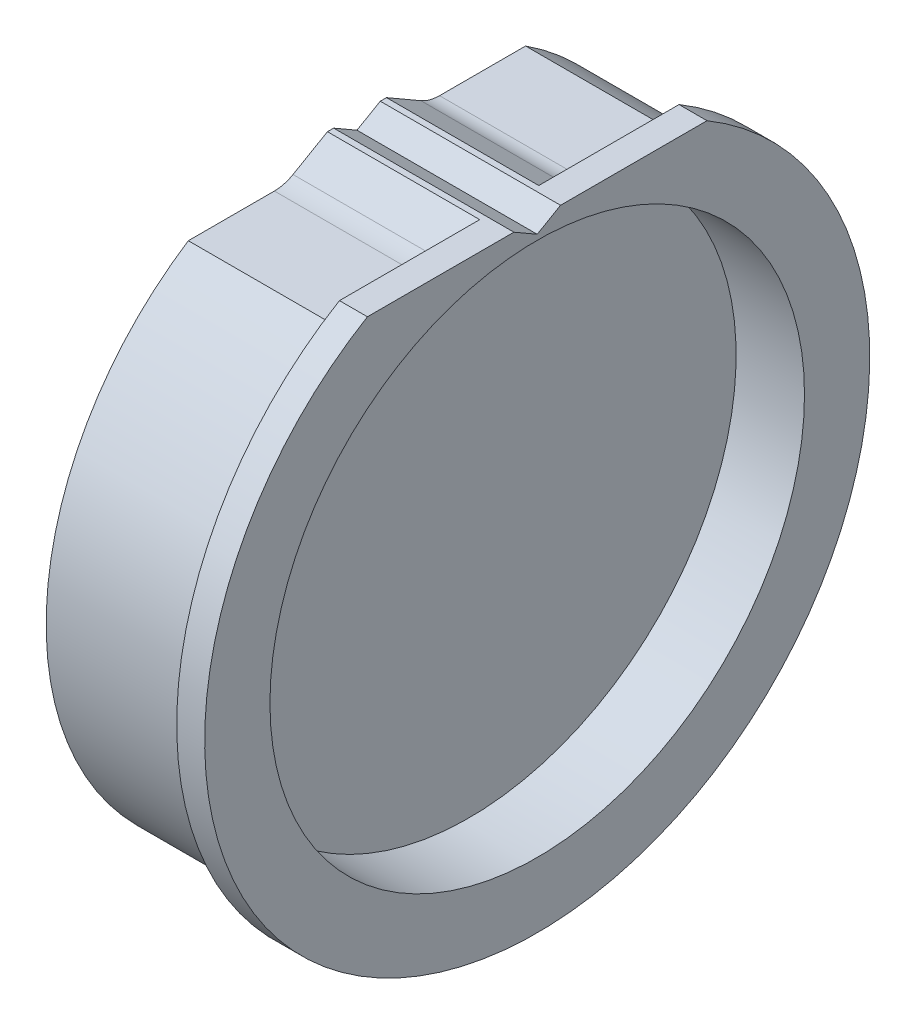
ISO-10303-21;
HEADER;
FILE_DESCRIPTION(('STEP AP214'),'2;1');
FILE_NAME('part.step','',(''),(''),'','','');
FILE_SCHEMA(('AUTOMOTIVE_DESIGN { 1 0 10303 214 1 1 1 1 }'));
ENDSEC;
DATA;
#1=APPLICATION_CONTEXT('core data for automotive mechanical design processes');
#2=APPLICATION_PROTOCOL_DEFINITION('international standard','automotive_design',2000,#1);
#3=PRODUCT_CONTEXT('',#1,'mechanical');
#4=PRODUCT('Part','Part','',(#3));
#5=PRODUCT_RELATED_PRODUCT_CATEGORY('part','',(#4));
#6=PRODUCT_DEFINITION_FORMATION('','',#4);
#7=PRODUCT_DEFINITION_CONTEXT('part definition',#1,'design');
#8=PRODUCT_DEFINITION('design','',#6,#7);
#9=PRODUCT_DEFINITION_SHAPE('','',#8);
#10=(LENGTH_UNIT() NAMED_UNIT(*) SI_UNIT(.MILLI.,.METRE.));
#11=(NAMED_UNIT(*) PLANE_ANGLE_UNIT() SI_UNIT($,.RADIAN.));
#12=(NAMED_UNIT(*) SI_UNIT($,.STERADIAN.) SOLID_ANGLE_UNIT());
#13=UNCERTAINTY_MEASURE_WITH_UNIT(LENGTH_MEASURE(1.E-05),#10,'distance_accuracy_value','');
#14=(GEOMETRIC_REPRESENTATION_CONTEXT(3) GLOBAL_UNCERTAINTY_ASSIGNED_CONTEXT((#13)) GLOBAL_UNIT_ASSIGNED_CONTEXT((#10,
#11,#12)) REPRESENTATION_CONTEXT('',''));
#15=CARTESIAN_POINT('',(0.,0.,0.));
#16=DIRECTION('',(0.,0.,1.));
#17=DIRECTION('',(1.,0.,0.));
#18=AXIS2_PLACEMENT_3D('',#15,#16,#17);
#19=CARTESIAN_POINT('',(6.5,53.5,0.));
#20=DIRECTION('',(1.,0.,0.));
#21=DIRECTION('',(0.,0.,-1.));
#22=AXIS2_PLACEMENT_3D('',#19,#20,#21);
#23=PLANE('',#22);
#24=DIRECTION('',(0.,0.,-1.));
#25=VECTOR('',#24,1.);
#26=CARTESIAN_POINT('',(6.5,3.,0.));
#27=LINE('',#26,#25);
#28=CARTESIAN_POINT('',(6.5,3.,-50.5));
#29=VERTEX_POINT('',#28);
#30=CARTESIAN_POINT('',(6.5,3.,-53.4158216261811));
#31=VERTEX_POINT('',#30);
#32=EDGE_CURVE('E171',#29,#31,#27,.T.);
#33=ORIENTED_EDGE('',*,*,#32,.F.);
#34=DIRECTION('',(0.,-1.,0.));
#35=VECTOR('',#34,1.);
#36=CARTESIAN_POINT('',(6.5,53.5,-50.5));
#37=LINE('',#36,#35);
#38=CARTESIAN_POINT('',(6.5,-3.,-50.5));
#39=VERTEX_POINT('',#38);
#40=EDGE_CURVE('E10',#29,#39,#37,.T.);
#41=ORIENTED_EDGE('',*,*,#40,.T.);
#42=DIRECTION('',(0.,0.,1.));
#43=VECTOR('',#42,1.);
#44=CARTESIAN_POINT('',(6.5,-3.,0.));
#45=LINE('',#44,#43);
#46=CARTESIAN_POINT('',(6.5,-3.,-53.4158216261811));
#47=VERTEX_POINT('',#46);
#48=EDGE_CURVE('E169',#47,#39,#45,.T.);
#49=ORIENTED_EDGE('',*,*,#48,.F.);
#50=CARTESIAN_POINT('',(6.5,0.,0.));
#51=DIRECTION('',(-1.,0.,0.));
#52=DIRECTION('',(0.,0.,1.));
#53=AXIS2_PLACEMENT_3D('',#50,#51,#52);
#54=CIRCLE('',#53,53.5);
#55=CARTESIAN_POINT('',(6.5,46.,27.3175767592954));
#56=VERTEX_POINT('',#55);
#57=EDGE_CURVE('E283',#47,#56,#54,.T.);
#58=ORIENTED_EDGE('',*,*,#57,.T.);
#59=DIRECTION('',(0.,0.,-1.));
#60=VECTOR('',#59,1.);
#61=CARTESIAN_POINT('',(6.5,46.,0.));
#62=LINE('',#61,#60);
#63=CARTESIAN_POINT('',(6.5,46.,4.75));
#64=VERTEX_POINT('',#63);
#65=EDGE_CURVE('E249',#56,#64,#62,.T.);
#66=ORIENTED_EDGE('',*,*,#65,.T.);
#67=DIRECTION('',(0.,-0.5,0.866025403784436));
#68=VECTOR('',#67,1.);
#69=CARTESIAN_POINT('',(6.5,46.,4.75));
#70=LINE('',#69,#68);
#71=CARTESIAN_POINT('',(6.5,42.8038475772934,10.2858983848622));
#72=VERTEX_POINT('',#71);
#73=EDGE_CURVE('E204',#64,#72,#70,.T.);
#74=ORIENTED_EDGE('',*,*,#73,.T.);
#75=CARTESIAN_POINT('',(6.5,48.,13.2858983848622));
#76=DIRECTION('',(1.,0.,0.));
#77=DIRECTION('',(0.,0.,-1.));
#78=AXIS2_PLACEMENT_3D('',#75,#76,#77);
#79=CIRCLE('',#78,6.);
#80=CARTESIAN_POINT('',(6.5,42.,13.2858983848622));
#81=VERTEX_POINT('',#80);
#82=EDGE_CURVE('E306',#72,#81,#79,.F.);
#83=ORIENTED_EDGE('',*,*,#82,.T.);
#84=DIRECTION('',(0.,0.,1.));
#85=VECTOR('',#84,1.);
#86=CARTESIAN_POINT('',(6.5,42.,11.6782032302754));
#87=LINE('',#86,#85);
#88=CARTESIAN_POINT('',(6.5,42.,27.1293199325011));
#89=VERTEX_POINT('',#88);
#90=EDGE_CURVE('E201',#81,#89,#87,.T.);
#91=ORIENTED_EDGE('',*,*,#90,.T.);
#92=CARTESIAN_POINT('',(6.5,0.,0.));
#93=DIRECTION('',(-1.,0.,0.));
#94=DIRECTION('',(0.,0.,1.));
#95=AXIS2_PLACEMENT_3D('',#92,#93,#94);
#96=CIRCLE('',#95,50.);
#97=CARTESIAN_POINT('',(6.5,42.,-27.1293199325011));
#98=VERTEX_POINT('',#97);
#99=EDGE_CURVE('E287',#98,#89,#96,.T.);
#100=ORIENTED_EDGE('',*,*,#99,.F.);
#101=DIRECTION('',(0.,0.,1.));
#102=VECTOR('',#101,1.);
#103=CARTESIAN_POINT('',(6.5,42.,-11.6782032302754));
#104=LINE('',#103,#102);
#105=CARTESIAN_POINT('',(6.5,42.,-13.2858983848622));
#106=VERTEX_POINT('',#105);
#107=EDGE_CURVE('E213',#98,#106,#104,.T.);
#108=ORIENTED_EDGE('',*,*,#107,.T.);
#109=CARTESIAN_POINT('',(6.5,48.,-13.2858983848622));
#110=DIRECTION('',(1.,0.,0.));
#111=DIRECTION('',(0.,0.,-1.));
#112=AXIS2_PLACEMENT_3D('',#109,#110,#111);
#113=CIRCLE('',#112,6.);
#114=CARTESIAN_POINT('',(6.5,42.8038475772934,-10.2858983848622));
#115=VERTEX_POINT('',#114);
#116=EDGE_CURVE('E304',#106,#115,#113,.F.);
#117=ORIENTED_EDGE('',*,*,#116,.T.);
#118=DIRECTION('',(0.,0.5,0.866025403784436));
#119=VECTOR('',#118,1.);
#120=CARTESIAN_POINT('',(6.5,46.,-4.75));
#121=LINE('',#120,#119);
#122=CARTESIAN_POINT('',(6.5,46.,-4.75));
#123=VERTEX_POINT('',#122);
#124=EDGE_CURVE('E215',#115,#123,#121,.T.);
#125=ORIENTED_EDGE('',*,*,#124,.T.);
#126=CARTESIAN_POINT('',(6.5,46.,-27.3175767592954));
#127=VERTEX_POINT('',#126);
#128=EDGE_CURVE('E245',#123,#127,#62,.T.);
#129=ORIENTED_EDGE('',*,*,#128,.T.);
#130=EDGE_CURVE('E284',#127,#31,#54,.T.);
#131=ORIENTED_EDGE('',*,*,#130,.T.);
#132=EDGE_LOOP('',(#33,#41,#49,#58,#66,#74,#83,#91,#100,#108,#117,#125,#129,#131));
#133=FACE_BOUND('',#132,.T.);
#134=ADVANCED_FACE('F16',(#133),#23,.F.);
#135=CARTESIAN_POINT('',(0.,0.,0.));
#136=DIRECTION('',(-1.,0.,0.));
#137=DIRECTION('',(0.,0.,1.));
#138=AXIS2_PLACEMENT_3D('',#135,#136,#137);
#139=CYLINDRICAL_SURFACE('',#138,53.5);
#140=DIRECTION('',(-1.,0.,0.));
#141=VECTOR('',#140,1.);
#142=CARTESIAN_POINT('',(0.,3.,-53.4158216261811));
#143=LINE('',#142,#141);
#144=CARTESIAN_POINT('',(7.5,3.,-53.4158216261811));
#145=VERTEX_POINT('',#144);
#146=EDGE_CURVE('E24',#31,#145,#143,.F.);
#147=ORIENTED_EDGE('',*,*,#146,.F.);
#148=ORIENTED_EDGE('',*,*,#130,.F.);
#149=DIRECTION('',(-1.,0.,0.));
#150=VECTOR('',#149,1.);
#151=CARTESIAN_POINT('',(17.4,46.,-27.3175767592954));
#152=LINE('',#151,#150);
#153=CARTESIAN_POINT('',(11.,46.,-27.3175767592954));
#154=VERTEX_POINT('',#153);
#155=EDGE_CURVE('E241',#154,#127,#152,.T.);
#156=ORIENTED_EDGE('',*,*,#155,.F.);
#157=CARTESIAN_POINT('',(11.,0.,0.));
#158=DIRECTION('',(1.,0.,0.));
#159=DIRECTION('',(0.,0.,-1.));
#160=AXIS2_PLACEMENT_3D('',#157,#158,#159);
#161=CIRCLE('',#160,53.5);
#162=CARTESIAN_POINT('',(11.,46.,27.3175767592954));
#163=VERTEX_POINT('',#162);
#164=EDGE_CURVE('E192',#163,#154,#161,.T.);
#165=ORIENTED_EDGE('',*,*,#164,.F.);
#166=DIRECTION('',(-1.,0.,0.));
#167=VECTOR('',#166,1.);
#168=CARTESIAN_POINT('',(17.4,46.,27.3175767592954));
#169=LINE('',#168,#167);
#170=EDGE_CURVE('E242',#163,#56,#169,.T.);
#171=ORIENTED_EDGE('',*,*,#170,.T.);
#172=ORIENTED_EDGE('',*,*,#57,.F.);
#173=DIRECTION('',(-1.,0.,0.));
#174=VECTOR('',#173,1.);
#175=CARTESIAN_POINT('',(0.,-3.,-53.4158216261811));
#176=LINE('',#175,#174);
#177=CARTESIAN_POINT('',(7.5,-3.,-53.4158216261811));
#178=VERTEX_POINT('',#177);
#179=EDGE_CURVE('E316',#178,#47,#176,.T.);
#180=ORIENTED_EDGE('',*,*,#179,.F.);
#181=CARTESIAN_POINT('',(7.5,3.,-53.4158216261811));
#182=CARTESIAN_POINT('',(7.58430719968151,3.00000816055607,-53.4158196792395));
#183=CARTESIAN_POINT('',(7.66861047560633,2.99644618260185,-53.4160211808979));
#184=CARTESIAN_POINT('',(7.83661258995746,2.9822451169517,-53.4168167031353));
#185=CARTESIAN_POINT('',(7.92031146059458,2.97160640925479,-53.4174107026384));
#186=CARTESIAN_POINT('',(8.08645359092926,2.94332589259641,-53.4189762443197));
#187=CARTESIAN_POINT('',(8.16889776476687,2.92568946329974,-53.419947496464));
#188=CARTESIAN_POINT('',(8.33198480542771,2.88355760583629,-53.4222382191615));
#189=CARTESIAN_POINT('',(8.41262769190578,2.85906225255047,-53.4235576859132));
#190=CARTESIAN_POINT('',(8.65106994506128,2.77549001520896,-53.4279872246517));
#191=CARTESIAN_POINT('',(8.80545801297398,2.70631409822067,-53.431569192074));
#192=CARTESIAN_POINT('',(9.10031757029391,2.5431114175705,-53.4395846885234));
#193=CARTESIAN_POINT('',(9.24079145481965,2.44908894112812,-53.4440180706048));
#194=CARTESIAN_POINT('',(9.50413603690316,2.23871631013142,-53.453243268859));
#195=CARTESIAN_POINT('',(9.62698896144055,2.12234388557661,-53.4580354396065));
#196=CARTESIAN_POINT('',(9.8514375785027,1.87061187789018,-53.4674353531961));
#197=CARTESIAN_POINT('',(9.95303003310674,1.73524940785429,-53.4720430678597));
#198=CARTESIAN_POINT('',(10.1321180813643,1.4492864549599,-53.4805573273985));
#199=CARTESIAN_POINT('',(10.2095987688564,1.29867662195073,-53.4844634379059));
#200=CARTESIAN_POINT('',(10.3381617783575,0.986570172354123,-53.4911302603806));
#201=CARTESIAN_POINT('',(10.3892459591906,0.825074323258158,-53.4938910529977));
#202=CARTESIAN_POINT('',(10.4635221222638,0.495950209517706,-53.4979539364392));
#203=CARTESIAN_POINT('',(10.4867431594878,0.328328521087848,-53.4992575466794));
#204=CARTESIAN_POINT('',(10.5047235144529,-0.00844245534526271,-53.5002642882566));
#205=CARTESIAN_POINT('',(10.4994823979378,-0.177591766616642,-53.4999673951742));
#206=CARTESIAN_POINT('',(10.4607103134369,-0.512410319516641,-53.4978078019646));
#207=CARTESIAN_POINT('',(10.4272114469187,-0.678083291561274,-53.4959468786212));
#208=CARTESIAN_POINT('',(10.3329246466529,-1.00145003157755,-53.4908708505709));
#209=CARTESIAN_POINT('',(10.2721366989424,-1.15914379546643,-53.4876557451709));
#210=CARTESIAN_POINT('',(10.1249594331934,-1.46218284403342,-53.4802303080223));
#211=CARTESIAN_POINT('',(10.038554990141,-1.60752076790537,-53.4760193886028));
#212=CARTESIAN_POINT('',(9.84261254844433,-1.88163435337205,-53.4670766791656));
#213=CARTESIAN_POINT('',(9.73307544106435,-2.01041065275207,-53.4623449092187));
#214=CARTESIAN_POINT('',(9.49381357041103,-2.24792345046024,-53.4528859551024));
#215=CARTESIAN_POINT('',(9.36406386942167,-2.35663482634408,-53.4481587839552));
#216=CARTESIAN_POINT('',(9.08809080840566,-2.55077060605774,-53.4392463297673));
#217=CARTESIAN_POINT('',(8.94186230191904,-2.63618770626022,-53.4350612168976));
#218=CARTESIAN_POINT('',(8.63704819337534,-2.78130439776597,-53.427704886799));
#219=CARTESIAN_POINT('',(8.4784546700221,-2.84098734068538,-53.4245343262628));
#220=CARTESIAN_POINT('',(8.15359853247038,-2.93278114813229,-53.4195745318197));
#221=CARTESIAN_POINT('',(7.98734800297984,-2.96493399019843,-53.417783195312));
#222=CARTESIAN_POINT('',(7.7666451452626,-2.98860759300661,-53.4164603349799));
#223=CARTESIAN_POINT('',(7.71335898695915,-2.99288196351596,-53.4162209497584));
#224=CARTESIAN_POINT('',(7.60672247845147,-2.9985742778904,-53.4159018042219));
#225=CARTESIAN_POINT('',(7.55337238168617,-2.99999695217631,-53.4158217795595));
#226=CARTESIAN_POINT('',(7.5,-3.,-53.4158216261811));
#227=B_SPLINE_CURVE_WITH_KNOTS('',3,(#181,#182,#183,#184,#185,#186,#187,#188,#189,#190,#191,
#192,#193,#194,#195,#196,#197,#198,#199,#200,#201,#202,#203,#204,#205,#206,#207,#208,#209,#210,
#211,#212,#213,#214,#215,#216,#217,#218,#219,#220,#221,#222,#223,#224,#225,#226),.UNSPECIFIED.,
.F.,.F.,(4,2,2,2,2,2,2,2,2,2,2,2,2,2,2,2,2,2,2,2,2,2,4),(0.,0.252839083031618,0.505664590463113,
0.758296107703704,1.01092486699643,1.51595665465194,2.02090135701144,2.52635183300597,
3.03187923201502,3.53771853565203,4.04352221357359,4.54879799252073,5.0540814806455,
5.55879172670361,6.06350223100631,6.56851133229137,7.07350097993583,7.57911867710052,
8.08489472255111,8.59099748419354,9.09632716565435,9.25664689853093,9.41670047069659),.UNSPECIFIED.);
#228=EDGE_CURVE('E318',#145,#178,#227,.T.);
#229=ORIENTED_EDGE('',*,*,#228,.F.);
#230=EDGE_LOOP('',(#147,#148,#156,#165,#171,#172,#180,#229));
#231=FACE_BOUND('',#230,.T.);
#232=ADVANCED_FACE('F324',(#231),#139,.T.);
#233=CARTESIAN_POINT('',(17.4,46.,27.3175767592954));
#234=DIRECTION('',(0.,-1.,0.));
#235=DIRECTION('',(0.,0.,-1.));
#236=AXIS2_PLACEMENT_3D('',#233,#234,#235);
#237=PLANE('',#236);
#238=DIRECTION('',(-1.,0.,0.));
#239=VECTOR('',#238,1.);
#240=CARTESIAN_POINT('',(35.1702611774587,46.,4.75));
#241=LINE('',#240,#239);
#242=CARTESIAN_POINT('',(-18.,46.,4.75));
#243=VERTEX_POINT('',#242);
#244=EDGE_CURVE('E198',#64,#243,#241,.T.);
#245=ORIENTED_EDGE('',*,*,#244,.F.);
#246=ORIENTED_EDGE('',*,*,#65,.F.);
#247=ORIENTED_EDGE('',*,*,#170,.F.);
#248=DIRECTION('',(0.,0.,1.));
#249=VECTOR('',#248,1.);
#250=CARTESIAN_POINT('',(11.,46.,3.75));
#251=LINE('',#250,#249);
#252=CARTESIAN_POINT('',(11.,46.,3.75));
#253=VERTEX_POINT('',#252);
#254=EDGE_CURVE('E189',#253,#163,#251,.T.);
#255=ORIENTED_EDGE('',*,*,#254,.F.);
#256=DIRECTION('',(-1.,0.,0.));
#257=VECTOR('',#256,1.);
#258=CARTESIAN_POINT('',(10.001,46.,3.75));
#259=LINE('',#258,#257);
#260=CARTESIAN_POINT('',(-18.,46.,3.75));
#261=VERTEX_POINT('',#260);
#262=EDGE_CURVE('E230',#253,#261,#259,.T.);
#263=ORIENTED_EDGE('',*,*,#262,.T.);
#264=DIRECTION('',(0.,0.,1.));
#265=VECTOR('',#264,1.);
#266=CARTESIAN_POINT('',(-18.,46.,27.3175767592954));
#267=LINE('',#266,#265);
#268=EDGE_CURVE('E233',#261,#243,#267,.T.);
#269=ORIENTED_EDGE('',*,*,#268,.T.);
#270=EDGE_LOOP('',(#245,#246,#247,#255,#263,#269));
#271=FACE_BOUND('',#270,.T.);
#272=ADVANCED_FACE('F375',(#271),#237,.F.);
#273=CARTESIAN_POINT('',(-12.,0.,0.));
#274=DIRECTION('',(1.,0.,0.));
#275=DIRECTION('',(0.,0.,-1.));
#276=AXIS2_PLACEMENT_3D('',#273,#274,#275);
#277=PLANE('',#276);
#278=CARTESIAN_POINT('',(-12.,0.,0.));
#279=DIRECTION('',(-1.,0.,0.));
#280=DIRECTION('',(0.,0.,1.));
#281=AXIS2_PLACEMENT_3D('',#278,#279,#280);
#282=CIRCLE('',#281,20.);
#283=CARTESIAN_POINT('',(-12.,0.,20.));
#284=VERTEX_POINT('',#283);
#285=EDGE_CURVE('E296',#284,#284,#282,.T.);
#286=ORIENTED_EDGE('',*,*,#285,.T.);
#287=EDGE_LOOP('',(#286));
#288=FACE_BOUND('',#287,.T.);
#289=ADVANCED_FACE('F18',(#288),#277,.F.);
#290=CARTESIAN_POINT('',(0.,0.,0.));
#291=DIRECTION('',(-1.,0.,0.));
#292=DIRECTION('',(0.,0.,1.));
#293=AXIS2_PLACEMENT_3D('',#290,#291,#292);
#294=CYLINDRICAL_SURFACE('',#293,20.);
#295=ORIENTED_EDGE('',*,*,#285,.F.);
#296=EDGE_LOOP('',(#295));
#297=FACE_BOUND('',#296,.T.);
#298=CARTESIAN_POINT('',(-18.,0.,0.));
#299=DIRECTION('',(-1.,0.,0.));
#300=DIRECTION('',(0.,0.,1.));
#301=AXIS2_PLACEMENT_3D('',#298,#299,#300);
#302=CIRCLE('',#301,20.);
#303=CARTESIAN_POINT('',(-18.,0.,20.));
#304=VERTEX_POINT('',#303);
#305=EDGE_CURVE('E293',#304,#304,#302,.T.);
#306=ORIENTED_EDGE('',*,*,#305,.T.);
#307=EDGE_LOOP('',(#306));
#308=FACE_BOUND('',#307,.T.);
#309=ADVANCED_FACE('F441',(#297,#308),#294,.F.);
#310=CARTESIAN_POINT('',(-18.,20.,0.));
#311=DIRECTION('',(1.,0.,0.));
#312=DIRECTION('',(0.,0.,-1.));
#313=AXIS2_PLACEMENT_3D('',#310,#311,#312);
#314=PLANE('',#313);
#315=CARTESIAN_POINT('',(-18.,31.5,0.));
#316=DIRECTION('',(-1.,0.,0.));
#317=DIRECTION('',(0.,0.,1.));
#318=AXIS2_PLACEMENT_3D('',#315,#316,#317);
#319=CIRCLE('',#318,3.);
#320=CARTESIAN_POINT('',(-18.,31.5,3.));
#321=VERTEX_POINT('',#320);
#322=EDGE_CURVE('E250',#321,#321,#319,.T.);
#323=ORIENTED_EDGE('',*,*,#322,.F.);
#324=EDGE_LOOP('',(#323));
#325=FACE_BOUND('',#324,.T.);
#326=CARTESIAN_POINT('',(-18.,-22.2738636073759,-22.2738636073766));
#327=DIRECTION('',(-1.,0.,0.));
#328=DIRECTION('',(0.,0.,1.));
#329=AXIS2_PLACEMENT_3D('',#326,#327,#328);
#330=CIRCLE('',#329,2.5);
#331=CARTESIAN_POINT('',(-18.,-22.2738636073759,-19.7738636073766));
#332=VERTEX_POINT('',#331);
#333=EDGE_CURVE('E259',#332,#332,#330,.T.);
#334=ORIENTED_EDGE('',*,*,#333,.F.);
#335=EDGE_LOOP('',(#334));
#336=FACE_BOUND('',#335,.T.);
#337=CARTESIAN_POINT('',(-18.,-22.2738636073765,22.273863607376));
#338=DIRECTION('',(-1.,0.,0.));
#339=DIRECTION('',(0.,0.,1.));
#340=AXIS2_PLACEMENT_3D('',#337,#338,#339);
#341=CIRCLE('',#340,2.5);
#342=CARTESIAN_POINT('',(-18.,-22.2738636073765,24.773863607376));
#343=VERTEX_POINT('',#342);
#344=EDGE_CURVE('E265',#343,#343,#341,.T.);
#345=ORIENTED_EDGE('',*,*,#344,.F.);
#346=EDGE_LOOP('',(#345));
#347=FACE_BOUND('',#346,.T.);
#348=CARTESIAN_POINT('',(-18.,22.2738636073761,22.2738636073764));
#349=DIRECTION('',(-1.,0.,0.));
#350=DIRECTION('',(0.,0.,1.));
#351=AXIS2_PLACEMENT_3D('',#348,#349,#350);
#352=CIRCLE('',#351,2.5);
#353=CARTESIAN_POINT('',(-18.,22.2738636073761,24.7738636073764));
#354=VERTEX_POINT('',#353);
#355=EDGE_CURVE('E271',#354,#354,#352,.T.);
#356=ORIENTED_EDGE('',*,*,#355,.F.);
#357=EDGE_LOOP('',(#356));
#358=FACE_BOUND('',#357,.T.);
#359=CARTESIAN_POINT('',(-18.,22.2738636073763,-22.2738636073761));
#360=DIRECTION('',(-1.,0.,0.));
#361=DIRECTION('',(0.,0.,1.));
#362=AXIS2_PLACEMENT_3D('',#359,#360,#361);
#363=CIRCLE('',#362,2.5);
#364=CARTESIAN_POINT('',(-18.,22.2738636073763,-19.7738636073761));
#365=VERTEX_POINT('',#364);
#366=EDGE_CURVE('E277',#365,#365,#363,.T.);
#367=ORIENTED_EDGE('',*,*,#366,.F.);
#368=EDGE_LOOP('',(#367));
#369=FACE_BOUND('',#368,.T.);
#370=ORIENTED_EDGE('',*,*,#305,.F.);
#371=EDGE_LOOP('',(#370));
#372=FACE_BOUND('',#371,.T.);
#373=DIRECTION('',(0.,0.,1.));
#374=VECTOR('',#373,1.);
#375=CARTESIAN_POINT('',(-18.,42.,11.6782032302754));
#376=LINE('',#375,#374);
#377=CARTESIAN_POINT('',(-18.,42.,13.2858983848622));
#378=VERTEX_POINT('',#377);
#379=CARTESIAN_POINT('',(-18.,42.,27.1293199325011));
#380=VERTEX_POINT('',#379);
#381=EDGE_CURVE('E196',#378,#380,#376,.T.);
#382=ORIENTED_EDGE('',*,*,#381,.F.);
#383=CARTESIAN_POINT('',(-18.,48.,13.2858983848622));
#384=DIRECTION('',(1.,0.,0.));
#385=DIRECTION('',(0.,0.,-1.));
#386=AXIS2_PLACEMENT_3D('',#383,#384,#385);
#387=CIRCLE('',#386,6.);
#388=CARTESIAN_POINT('',(-18.,42.8038475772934,10.2858983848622));
#389=VERTEX_POINT('',#388);
#390=EDGE_CURVE('E313',#378,#389,#387,.T.);
#391=ORIENTED_EDGE('',*,*,#390,.T.);
#392=DIRECTION('',(0.,-0.5,0.866025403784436));
#393=VECTOR('',#392,1.);
#394=CARTESIAN_POINT('',(-18.,46.,4.75));
#395=LINE('',#394,#393);
#396=EDGE_CURVE('E195',#243,#389,#395,.T.);
#397=ORIENTED_EDGE('',*,*,#396,.F.);
#398=ORIENTED_EDGE('',*,*,#268,.F.);
#399=DIRECTION('',(0.,0.5,0.866025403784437));
#400=VECTOR('',#399,1.);
#401=CARTESIAN_POINT('',(-18.,43.8349364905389,0.));
#402=LINE('',#401,#400);
#403=CARTESIAN_POINT('',(-18.,43.8349364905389,0.));
#404=VERTEX_POINT('',#403);
#405=EDGE_CURVE('E225',#404,#261,#402,.T.);
#406=ORIENTED_EDGE('',*,*,#405,.F.);
#407=DIRECTION('',(0.,-0.500000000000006,0.866025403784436));
#408=VECTOR('',#407,1.);
#409=CARTESIAN_POINT('',(-18.,46.,-3.75));
#410=LINE('',#409,#408);
#411=CARTESIAN_POINT('',(-18.,46.,-3.75));
#412=VERTEX_POINT('',#411);
#413=EDGE_CURVE('E227',#412,#404,#410,.T.);
#414=ORIENTED_EDGE('',*,*,#413,.F.);
#415=CARTESIAN_POINT('',(-18.,46.,-4.75));
#416=VERTEX_POINT('',#415);
#417=EDGE_CURVE('E239',#416,#412,#267,.T.);
#418=ORIENTED_EDGE('',*,*,#417,.F.);
#419=DIRECTION('',(0.,0.5,0.866025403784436));
#420=VECTOR('',#419,1.);
#421=CARTESIAN_POINT('',(-18.,46.,-4.75));
#422=LINE('',#421,#420);
#423=CARTESIAN_POINT('',(-18.,42.8038475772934,-10.2858983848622));
#424=VERTEX_POINT('',#423);
#425=EDGE_CURVE('E211',#424,#416,#422,.T.);
#426=ORIENTED_EDGE('',*,*,#425,.F.);
#427=CARTESIAN_POINT('',(-18.,48.,-13.2858983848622));
#428=DIRECTION('',(1.,0.,0.));
#429=DIRECTION('',(0.,0.,-1.));
#430=AXIS2_PLACEMENT_3D('',#427,#428,#429);
#431=CIRCLE('',#430,6.);
#432=CARTESIAN_POINT('',(-18.,42.,-13.2858983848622));
#433=VERTEX_POINT('',#432);
#434=EDGE_CURVE('E39',#424,#433,#431,.T.);
#435=ORIENTED_EDGE('',*,*,#434,.T.);
#436=DIRECTION('',(0.,0.,1.));
#437=VECTOR('',#436,1.);
#438=CARTESIAN_POINT('',(-18.,42.,-11.6782032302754));
#439=LINE('',#438,#437);
#440=CARTESIAN_POINT('',(-18.,42.,-27.1293199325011));
#441=VERTEX_POINT('',#440);
#442=EDGE_CURVE('E210',#441,#433,#439,.T.);
#443=ORIENTED_EDGE('',*,*,#442,.F.);
#444=CARTESIAN_POINT('',(-18.,0.,0.));
#445=DIRECTION('',(-1.,0.,0.));
#446=DIRECTION('',(0.,0.,1.));
#447=AXIS2_PLACEMENT_3D('',#444,#445,#446);
#448=CIRCLE('',#447,50.);
#449=EDGE_CURVE('E290',#441,#380,#448,.T.);
#450=ORIENTED_EDGE('',*,*,#449,.T.);
#451=EDGE_LOOP('',(#382,#391,#397,#398,#406,#414,#418,#426,#435,#443,#450));
#452=FACE_BOUND('',#451,.T.);
#453=ADVANCED_FACE('F438',(#325,#336,#347,#358,#369,#372,#452),#314,.F.);
#454=CARTESIAN_POINT('',(0.,0.,0.));
#455=DIRECTION('',(-1.,0.,0.));
#456=DIRECTION('',(0.,0.,1.));
#457=AXIS2_PLACEMENT_3D('',#454,#455,#456);
#458=CYLINDRICAL_SURFACE('',#457,50.);
#459=ORIENTED_EDGE('',*,*,#99,.T.);
#460=DIRECTION('',(-1.,0.,0.));
#461=VECTOR('',#460,1.);
#462=CARTESIAN_POINT('',(0.,42.,27.1293199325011));
#463=LINE('',#462,#461);
#464=EDGE_CURVE('E203',#89,#380,#463,.T.);
#465=ORIENTED_EDGE('',*,*,#464,.T.);
#466=ORIENTED_EDGE('',*,*,#449,.F.);
#467=DIRECTION('',(-1.,0.,0.));
#468=VECTOR('',#467,1.);
#469=CARTESIAN_POINT('',(0.,42.,-27.1293199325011));
#470=LINE('',#469,#468);
#471=EDGE_CURVE('E222',#441,#98,#470,.F.);
#472=ORIENTED_EDGE('',*,*,#471,.T.);
#473=EDGE_LOOP('',(#459,#465,#466,#472));
#474=FACE_BOUND('',#473,.T.);
#475=ADVANCED_FACE('F414',(#474),#458,.T.);
#476=CARTESIAN_POINT('',(-18.,22.2738636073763,-22.2738636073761));
#477=DIRECTION('',(-1.,0.,0.));
#478=DIRECTION('',(0.,0.,1.));
#479=AXIS2_PLACEMENT_3D('',#476,#477,#478);
#480=CYLINDRICAL_SURFACE('',#479,2.5);
#481=CARTESIAN_POINT('',(-4.,22.2738636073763,-22.2738636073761));
#482=DIRECTION('',(-1.,0.,0.));
#483=DIRECTION('',(0.,0.,1.));
#484=AXIS2_PLACEMENT_3D('',#481,#482,#483);
#485=CIRCLE('',#484,2.5);
#486=CARTESIAN_POINT('',(-4.,22.2738636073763,-19.7738636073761));
#487=VERTEX_POINT('',#486);
#488=EDGE_CURVE('E274',#487,#487,#485,.T.);
#489=ORIENTED_EDGE('',*,*,#488,.F.);
#490=EDGE_LOOP('',(#489));
#491=FACE_BOUND('',#490,.T.);
#492=ORIENTED_EDGE('',*,*,#366,.T.);
#493=EDGE_LOOP('',(#492));
#494=FACE_BOUND('',#493,.T.);
#495=ADVANCED_FACE('F410',(#491,#494),#480,.F.);
#496=CARTESIAN_POINT('',(-4.,22.2738636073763,-22.2738636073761));
#497=DIRECTION('',(-1.,0.,0.));
#498=DIRECTION('',(0.,0.,1.));
#499=AXIS2_PLACEMENT_3D('',#496,#497,#498);
#500=CONICAL_SURFACE('',#499,2.5,1.02974425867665);
#501=CARTESIAN_POINT('',(-2.49784845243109,22.2738636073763,-22.2738636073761));
#502=VERTEX_POINT('',#501);
#503=VERTEX_LOOP('',#502);
#504=FACE_BOUND('',#503,.T.);
#505=ORIENTED_EDGE('',*,*,#488,.T.);
#506=EDGE_LOOP('',(#505));
#507=FACE_BOUND('',#506,.T.);
#508=ADVANCED_FACE('F406',(#504,#507),#500,.F.);
#509=CARTESIAN_POINT('',(-18.,22.2738636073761,22.2738636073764));
#510=DIRECTION('',(-1.,0.,0.));
#511=DIRECTION('',(0.,0.,1.));
#512=AXIS2_PLACEMENT_3D('',#509,#510,#511);
#513=CYLINDRICAL_SURFACE('',#512,2.5);
#514=CARTESIAN_POINT('',(-4.,22.2738636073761,22.2738636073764));
#515=DIRECTION('',(-1.,0.,0.));
#516=DIRECTION('',(0.,0.,1.));
#517=AXIS2_PLACEMENT_3D('',#514,#515,#516);
#518=CIRCLE('',#517,2.5);
#519=CARTESIAN_POINT('',(-4.,22.2738636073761,24.7738636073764));
#520=VERTEX_POINT('',#519);
#521=EDGE_CURVE('E268',#520,#520,#518,.T.);
#522=ORIENTED_EDGE('',*,*,#521,.F.);
#523=EDGE_LOOP('',(#522));
#524=FACE_BOUND('',#523,.T.);
#525=ORIENTED_EDGE('',*,*,#355,.T.);
#526=EDGE_LOOP('',(#525));
#527=FACE_BOUND('',#526,.T.);
#528=ADVANCED_FACE('F402',(#524,#527),#513,.F.);
#529=CARTESIAN_POINT('',(-4.,22.2738636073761,22.2738636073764));
#530=DIRECTION('',(-1.,0.,0.));
#531=DIRECTION('',(0.,0.,1.));
#532=AXIS2_PLACEMENT_3D('',#529,#530,#531);
#533=CONICAL_SURFACE('',#532,2.5,1.02974425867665);
#534=CARTESIAN_POINT('',(-2.49784845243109,22.2738636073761,22.2738636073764));
#535=VERTEX_POINT('',#534);
#536=VERTEX_LOOP('',#535);
#537=FACE_BOUND('',#536,.T.);
#538=ORIENTED_EDGE('',*,*,#521,.T.);
#539=EDGE_LOOP('',(#538));
#540=FACE_BOUND('',#539,.T.);
#541=ADVANCED_FACE('F398',(#537,#540),#533,.F.);
#542=CARTESIAN_POINT('',(-18.,-22.2738636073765,22.273863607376));
#543=DIRECTION('',(-1.,0.,0.));
#544=DIRECTION('',(0.,0.,1.));
#545=AXIS2_PLACEMENT_3D('',#542,#543,#544);
#546=CYLINDRICAL_SURFACE('',#545,2.5);
#547=CARTESIAN_POINT('',(-4.,-22.2738636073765,22.273863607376));
#548=DIRECTION('',(-1.,0.,0.));
#549=DIRECTION('',(0.,0.,1.));
#550=AXIS2_PLACEMENT_3D('',#547,#548,#549);
#551=CIRCLE('',#550,2.5);
#552=CARTESIAN_POINT('',(-4.,-22.2738636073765,24.773863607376));
#553=VERTEX_POINT('',#552);
#554=EDGE_CURVE('E262',#553,#553,#551,.T.);
#555=ORIENTED_EDGE('',*,*,#554,.F.);
#556=EDGE_LOOP('',(#555));
#557=FACE_BOUND('',#556,.T.);
#558=ORIENTED_EDGE('',*,*,#344,.T.);
#559=EDGE_LOOP('',(#558));
#560=FACE_BOUND('',#559,.T.);
#561=ADVANCED_FACE('F394',(#557,#560),#546,.F.);
#562=CARTESIAN_POINT('',(-4.,-22.2738636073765,22.273863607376));
#563=DIRECTION('',(-1.,0.,0.));
#564=DIRECTION('',(0.,0.,1.));
#565=AXIS2_PLACEMENT_3D('',#562,#563,#564);
#566=CONICAL_SURFACE('',#565,2.5,1.02974425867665);
#567=CARTESIAN_POINT('',(-2.49784845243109,-22.2738636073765,22.273863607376));
#568=VERTEX_POINT('',#567);
#569=VERTEX_LOOP('',#568);
#570=FACE_BOUND('',#569,.T.);
#571=ORIENTED_EDGE('',*,*,#554,.T.);
#572=EDGE_LOOP('',(#571));
#573=FACE_BOUND('',#572,.T.);
#574=ADVANCED_FACE('F390',(#570,#573),#566,.F.);
#575=CARTESIAN_POINT('',(-18.,-22.2738636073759,-22.2738636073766));
#576=DIRECTION('',(-1.,0.,0.));
#577=DIRECTION('',(0.,0.,1.));
#578=AXIS2_PLACEMENT_3D('',#575,#576,#577);
#579=CYLINDRICAL_SURFACE('',#578,2.5);
#580=CARTESIAN_POINT('',(-4.,-22.2738636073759,-22.2738636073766));
#581=DIRECTION('',(-1.,0.,0.));
#582=DIRECTION('',(0.,0.,1.));
#583=AXIS2_PLACEMENT_3D('',#580,#581,#582);
#584=CIRCLE('',#583,2.5);
#585=CARTESIAN_POINT('',(-4.,-22.2738636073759,-19.7738636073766));
#586=VERTEX_POINT('',#585);
#587=EDGE_CURVE('E256',#586,#586,#584,.T.);
#588=ORIENTED_EDGE('',*,*,#587,.F.);
#589=EDGE_LOOP('',(#588));
#590=FACE_BOUND('',#589,.T.);
#591=ORIENTED_EDGE('',*,*,#333,.T.);
#592=EDGE_LOOP('',(#591));
#593=FACE_BOUND('',#592,.T.);
#594=ADVANCED_FACE('F386',(#590,#593),#579,.F.);
#595=CARTESIAN_POINT('',(-4.,-22.2738636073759,-22.2738636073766));
#596=DIRECTION('',(-1.,0.,0.));
#597=DIRECTION('',(0.,0.,1.));
#598=AXIS2_PLACEMENT_3D('',#595,#596,#597);
#599=CONICAL_SURFACE('',#598,2.5,1.02974425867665);
#600=CARTESIAN_POINT('',(-2.49784845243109,-22.2738636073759,-22.2738636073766));
#601=VERTEX_POINT('',#600);
#602=VERTEX_LOOP('',#601);
#603=FACE_BOUND('',#602,.T.);
#604=ORIENTED_EDGE('',*,*,#587,.T.);
#605=EDGE_LOOP('',(#604));
#606=FACE_BOUND('',#605,.T.);
#607=ADVANCED_FACE('F382',(#603,#606),#599,.F.);
#608=CARTESIAN_POINT('',(-8.,31.5,0.));
#609=DIRECTION('',(-1.,0.,0.));
#610=DIRECTION('',(0.,0.,1.));
#611=AXIS2_PLACEMENT_3D('',#608,#609,#610);
#612=CONICAL_SURFACE('',#611,3.,1.0471975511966);
#613=CARTESIAN_POINT('',(-6.26794919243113,31.5,0.));
#614=VERTEX_POINT('',#613);
#615=VERTEX_LOOP('',#614);
#616=FACE_BOUND('',#615,.T.);
#617=CARTESIAN_POINT('',(-8.,31.5,0.));
#618=DIRECTION('',(-1.,0.,0.));
#619=DIRECTION('',(0.,0.,1.));
#620=AXIS2_PLACEMENT_3D('',#617,#618,#619);
#621=CIRCLE('',#620,3.);
#622=CARTESIAN_POINT('',(-8.,31.5,3.));
#623=VERTEX_POINT('',#622);
#624=EDGE_CURVE('E253',#623,#623,#621,.T.);
#625=ORIENTED_EDGE('',*,*,#624,.T.);
#626=EDGE_LOOP('',(#625));
#627=FACE_BOUND('',#626,.T.);
#628=ADVANCED_FACE('F378',(#616,#627),#612,.F.);
#629=CARTESIAN_POINT('',(-18.,31.5,0.));
#630=DIRECTION('',(-1.,0.,0.));
#631=DIRECTION('',(0.,0.,1.));
#632=AXIS2_PLACEMENT_3D('',#629,#630,#631);
#633=CYLINDRICAL_SURFACE('',#632,3.);
#634=ORIENTED_EDGE('',*,*,#624,.F.);
#635=EDGE_LOOP('',(#634));
#636=FACE_BOUND('',#635,.T.);
#637=ORIENTED_EDGE('',*,*,#322,.T.);
#638=EDGE_LOOP('',(#637));
#639=FACE_BOUND('',#638,.T.);
#640=ADVANCED_FACE('F373',(#636,#639),#633,.F.);
#641=ORIENTED_EDGE('',*,*,#128,.F.);
#642=DIRECTION('',(-1.,0.,0.));
#643=VECTOR('',#642,1.);
#644=CARTESIAN_POINT('',(35.1702611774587,46.,-4.75));
#645=LINE('',#644,#643);
#646=EDGE_CURVE('E217',#123,#416,#645,.T.);
#647=ORIENTED_EDGE('',*,*,#646,.T.);
#648=ORIENTED_EDGE('',*,*,#417,.T.);
#649=DIRECTION('',(-1.,0.,0.));
#650=VECTOR('',#649,1.);
#651=CARTESIAN_POINT('',(10.001,46.,-3.75));
#652=LINE('',#651,#650);
#653=CARTESIAN_POINT('',(11.,46.,-3.75));
#654=VERTEX_POINT('',#653);
#655=EDGE_CURVE('E234',#654,#412,#652,.T.);
#656=ORIENTED_EDGE('',*,*,#655,.F.);
#657=DIRECTION('',(0.,0.,1.));
#658=VECTOR('',#657,1.);
#659=CARTESIAN_POINT('',(11.,46.,-27.3175767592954));
#660=LINE('',#659,#658);
#661=EDGE_CURVE('E180',#154,#654,#660,.T.);
#662=ORIENTED_EDGE('',*,*,#661,.F.);
#663=ORIENTED_EDGE('',*,*,#155,.T.);
#664=EDGE_LOOP('',(#641,#647,#648,#656,#662,#663));
#665=FACE_BOUND('',#664,.T.);
#666=ADVANCED_FACE('F369',(#665),#237,.F.);
#667=CARTESIAN_POINT('',(10.001,43.8349364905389,0.));
#668=DIRECTION('',(0.,-0.866025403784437,0.5));
#669=DIRECTION('',(0.,-0.5,-0.866025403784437));
#670=AXIS2_PLACEMENT_3D('',#667,#668,#669);
#671=PLANE('',#670);
#672=ORIENTED_EDGE('',*,*,#262,.F.);
#673=DIRECTION('',(0.,0.5,0.866025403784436));
#674=VECTOR('',#673,1.);
#675=CARTESIAN_POINT('',(11.,43.8349364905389,0.));
#676=LINE('',#675,#674);
#677=CARTESIAN_POINT('',(11.,43.8349364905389,0.));
#678=VERTEX_POINT('',#677);
#679=EDGE_CURVE('E186',#678,#253,#676,.T.);
#680=ORIENTED_EDGE('',*,*,#679,.F.);
#681=DIRECTION('',(-1.,0.,0.));
#682=VECTOR('',#681,1.);
#683=CARTESIAN_POINT('',(10.001,43.8349364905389,0.));
#684=LINE('',#683,#682);
#685=EDGE_CURVE('E231',#678,#404,#684,.T.);
#686=ORIENTED_EDGE('',*,*,#685,.T.);
#687=ORIENTED_EDGE('',*,*,#405,.T.);
#688=EDGE_LOOP('',(#672,#680,#686,#687));
#689=FACE_BOUND('',#688,.T.);
#690=ADVANCED_FACE('F365',(#689),#671,.F.);
#691=CARTESIAN_POINT('',(10.001,46.,-3.75));
#692=DIRECTION('',(0.,-0.866025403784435,-0.5));
#693=DIRECTION('',(0.,0.500000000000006,-0.866025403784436));
#694=AXIS2_PLACEMENT_3D('',#691,#692,#693);
#695=PLANE('',#694);
#696=ORIENTED_EDGE('',*,*,#685,.F.);
#697=DIRECTION('',(0.,-0.500000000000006,0.866025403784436));
#698=VECTOR('',#697,1.);
#699=CARTESIAN_POINT('',(11.,46.,-3.75));
#700=LINE('',#699,#698);
#701=EDGE_CURVE('E183',#654,#678,#700,.T.);
#702=ORIENTED_EDGE('',*,*,#701,.F.);
#703=ORIENTED_EDGE('',*,*,#655,.T.);
#704=ORIENTED_EDGE('',*,*,#413,.T.);
#705=EDGE_LOOP('',(#696,#702,#703,#704));
#706=FACE_BOUND('',#705,.T.);
#707=ADVANCED_FACE('F361',(#706),#695,.F.);
#708=CARTESIAN_POINT('',(35.1702611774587,42.,-11.6782032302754));
#709=DIRECTION('',(0.,-1.,0.));
#710=DIRECTION('',(0.,0.,-1.));
#711=AXIS2_PLACEMENT_3D('',#708,#709,#710);
#712=PLANE('',#711);
#713=ORIENTED_EDGE('',*,*,#442,.T.);
#714=DIRECTION('',(-1.,0.,0.));
#715=VECTOR('',#714,1.);
#716=CARTESIAN_POINT('',(6.5,42.,-13.2858983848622));
#717=LINE('',#716,#715);
#718=EDGE_CURVE('E311',#433,#106,#717,.F.);
#719=ORIENTED_EDGE('',*,*,#718,.T.);
#720=ORIENTED_EDGE('',*,*,#107,.F.);
#721=ORIENTED_EDGE('',*,*,#471,.F.);
#722=EDGE_LOOP('',(#713,#719,#720,#721));
#723=FACE_BOUND('',#722,.T.);
#724=ADVANCED_FACE('F357',(#723),#712,.F.);
#725=CARTESIAN_POINT('',(35.1702611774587,46.,-4.75));
#726=DIRECTION('',(0.,-0.866025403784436,0.5));
#727=DIRECTION('',(0.,-0.5,-0.866025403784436));
#728=AXIS2_PLACEMENT_3D('',#725,#726,#727);
#729=PLANE('',#728);
#730=ORIENTED_EDGE('',*,*,#124,.F.);
#731=DIRECTION('',(-1.,0.,0.));
#732=VECTOR('',#731,1.);
#733=CARTESIAN_POINT('',(-18.,42.8038475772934,-10.2858983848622));
#734=LINE('',#733,#732);
#735=EDGE_CURVE('E308',#115,#424,#734,.T.);
#736=ORIENTED_EDGE('',*,*,#735,.T.);
#737=ORIENTED_EDGE('',*,*,#425,.T.);
#738=ORIENTED_EDGE('',*,*,#646,.F.);
#739=EDGE_LOOP('',(#730,#736,#737,#738));
#740=FACE_BOUND('',#739,.T.);
#741=ADVANCED_FACE('F350',(#740),#729,.F.);
#742=CARTESIAN_POINT('',(35.1702611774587,42.,11.6782032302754));
#743=DIRECTION('',(0.,-1.,0.));
#744=DIRECTION('',(0.,0.,-1.));
#745=AXIS2_PLACEMENT_3D('',#742,#743,#744);
#746=PLANE('',#745);
#747=ORIENTED_EDGE('',*,*,#90,.F.);
#748=DIRECTION('',(-1.,0.,0.));
#749=VECTOR('',#748,1.);
#750=CARTESIAN_POINT('',(-18.,42.,13.2858983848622));
#751=LINE('',#750,#749);
#752=EDGE_CURVE('E299',#81,#378,#751,.T.);
#753=ORIENTED_EDGE('',*,*,#752,.T.);
#754=ORIENTED_EDGE('',*,*,#381,.T.);
#755=ORIENTED_EDGE('',*,*,#464,.F.);
#756=EDGE_LOOP('',(#747,#753,#754,#755));
#757=FACE_BOUND('',#756,.T.);
#758=ADVANCED_FACE('F347',(#757),#746,.F.);
#759=CARTESIAN_POINT('',(35.1702611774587,46.,4.75));
#760=DIRECTION('',(0.,-0.866025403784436,-0.5));
#761=DIRECTION('',(0.,0.5,-0.866025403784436));
#762=AXIS2_PLACEMENT_3D('',#759,#760,#761);
#763=PLANE('',#762);
#764=ORIENTED_EDGE('',*,*,#396,.T.);
#765=DIRECTION('',(-1.,0.,0.));
#766=VECTOR('',#765,1.);
#767=CARTESIAN_POINT('',(6.5,42.8038475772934,10.2858983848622));
#768=LINE('',#767,#766);
#769=EDGE_CURVE('E302',#389,#72,#768,.F.);
#770=ORIENTED_EDGE('',*,*,#769,.T.);
#771=ORIENTED_EDGE('',*,*,#73,.F.);
#772=ORIENTED_EDGE('',*,*,#244,.T.);
#773=EDGE_LOOP('',(#764,#770,#771,#772));
#774=FACE_BOUND('',#773,.T.);
#775=ADVANCED_FACE('F345',(#774),#763,.F.);
#776=CARTESIAN_POINT('',(35.1702611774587,48.,13.2858983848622));
#777=DIRECTION('',(1.,0.,0.));
#778=DIRECTION('',(0.,0.,-1.));
#779=AXIS2_PLACEMENT_3D('',#776,#777,#778);
#780=CYLINDRICAL_SURFACE('',#779,6.);
#781=ORIENTED_EDGE('',*,*,#82,.F.);
#782=ORIENTED_EDGE('',*,*,#769,.F.);
#783=ORIENTED_EDGE('',*,*,#390,.F.);
#784=ORIENTED_EDGE('',*,*,#752,.F.);
#785=EDGE_LOOP('',(#781,#782,#783,#784));
#786=FACE_BOUND('',#785,.T.);
#787=ADVANCED_FACE('F341',(#786),#780,.F.);
#788=CARTESIAN_POINT('',(35.1702611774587,48.,-13.2858983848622));
#789=DIRECTION('',(1.,0.,0.));
#790=DIRECTION('',(0.,0.,-1.));
#791=AXIS2_PLACEMENT_3D('',#788,#789,#790);
#792=CYLINDRICAL_SURFACE('',#791,6.);
#793=ORIENTED_EDGE('',*,*,#116,.F.);
#794=ORIENTED_EDGE('',*,*,#718,.F.);
#795=ORIENTED_EDGE('',*,*,#434,.F.);
#796=ORIENTED_EDGE('',*,*,#735,.F.);
#797=EDGE_LOOP('',(#793,#794,#795,#796));
#798=FACE_BOUND('',#797,.T.);
#799=ADVANCED_FACE('F337',(#798),#792,.F.);
#800=CARTESIAN_POINT('',(11.,0.,0.));
#801=DIRECTION('',(1.,0.,0.));
#802=DIRECTION('',(0.,0.,-1.));
#803=AXIS2_PLACEMENT_3D('',#800,#801,#802);
#804=PLANE('',#803);
#805=ORIENTED_EDGE('',*,*,#661,.T.);
#806=ORIENTED_EDGE('',*,*,#701,.T.);
#807=ORIENTED_EDGE('',*,*,#679,.T.);
#808=ORIENTED_EDGE('',*,*,#254,.T.);
#809=ORIENTED_EDGE('',*,*,#164,.T.);
#810=EDGE_LOOP('',(#805,#806,#807,#808,#809));
#811=FACE_BOUND('',#810,.T.);
#812=CARTESIAN_POINT('',(11.,0.,0.));
#813=DIRECTION('',(1.,0.,0.));
#814=DIRECTION('',(0.,0.,-1.));
#815=AXIS2_PLACEMENT_3D('',#812,#813,#814);
#816=CIRCLE('',#815,43.);
#817=CARTESIAN_POINT('',(11.,0.,-43.));
#818=VERTEX_POINT('',#817);
#819=EDGE_CURVE('E177',#818,#818,#816,.T.);
#820=ORIENTED_EDGE('',*,*,#819,.F.);
#821=EDGE_LOOP('',(#820));
#822=FACE_BOUND('',#821,.T.);
#823=ADVANCED_FACE('F333',(#811,#822),#804,.T.);
#824=CARTESIAN_POINT('',(0.,43.,0.));
#825=DIRECTION('',(-1.,0.,0.));
#826=DIRECTION('',(0.,0.,1.));
#827=AXIS2_PLACEMENT_3D('',#824,#825,#826);
#828=PLANE('',#827);
#829=CARTESIAN_POINT('',(0.,0.,0.));
#830=DIRECTION('',(-1.,0.,0.));
#831=DIRECTION('',(0.,0.,1.));
#832=AXIS2_PLACEMENT_3D('',#829,#830,#831);
#833=CIRCLE('',#832,43.);
#834=CARTESIAN_POINT('',(0.,0.,43.));
#835=VERTEX_POINT('',#834);
#836=EDGE_CURVE('E280',#835,#835,#833,.T.);
#837=ORIENTED_EDGE('',*,*,#836,.F.);
#838=EDGE_LOOP('',(#837));
#839=FACE_BOUND('',#838,.T.);
#840=ADVANCED_FACE('F336',(#839),#828,.F.);
#841=CARTESIAN_POINT('',(0.,0.,0.));
#842=DIRECTION('',(-1.,0.,0.));
#843=DIRECTION('',(0.,0.,1.));
#844=AXIS2_PLACEMENT_3D('',#841,#842,#843);
#845=CYLINDRICAL_SURFACE('',#844,43.);
#846=ORIENTED_EDGE('',*,*,#836,.T.);
#847=EDGE_LOOP('',(#846));
#848=FACE_BOUND('',#847,.T.);
#849=ORIENTED_EDGE('',*,*,#819,.T.);
#850=EDGE_LOOP('',(#849));
#851=FACE_BOUND('',#850,.T.);
#852=ADVANCED_FACE('F417',(#848,#851),#845,.F.);
#853=CARTESIAN_POINT('',(7.5,0.,-50.5));
#854=DIRECTION('',(0.,0.,1.));
#855=DIRECTION('',(1.,0.,0.));
#856=AXIS2_PLACEMENT_3D('',#853,#854,#855);
#857=PLANE('',#856);
#858=DIRECTION('',(-1.,0.,0.));
#859=VECTOR('',#858,1.);
#860=CARTESIAN_POINT('',(7.5,3.,-50.5));
#861=LINE('',#860,#859);
#862=CARTESIAN_POINT('',(7.5,3.,-50.5));
#863=VERTEX_POINT('',#862);
#864=EDGE_CURVE('E151',#863,#29,#861,.T.);
#865=ORIENTED_EDGE('',*,*,#864,.F.);
#866=CARTESIAN_POINT('',(7.5,0.,-50.5));
#867=DIRECTION('',(0.,0.,1.));
#868=DIRECTION('',(1.,0.,0.));
#869=AXIS2_PLACEMENT_3D('',#866,#867,#868);
#870=CIRCLE('',#869,3.);
#871=CARTESIAN_POINT('',(7.5,-3.,-50.5));
#872=VERTEX_POINT('',#871);
#873=EDGE_CURVE('E155',#872,#863,#870,.T.);
#874=ORIENTED_EDGE('',*,*,#873,.F.);
#875=DIRECTION('',(1.,0.,0.));
#876=VECTOR('',#875,1.);
#877=CARTESIAN_POINT('',(7.5,-3.,-50.5));
#878=LINE('',#877,#876);
#879=EDGE_CURVE('E159',#39,#872,#878,.T.);
#880=ORIENTED_EDGE('',*,*,#879,.F.);
#881=ORIENTED_EDGE('',*,*,#40,.F.);
#882=EDGE_LOOP('',(#865,#874,#880,#881));
#883=FACE_BOUND('',#882,.T.);
#884=ADVANCED_FACE('F153',(#883),#857,.F.);
#885=CARTESIAN_POINT('',(7.5,0.,-50.5));
#886=DIRECTION('',(0.,0.,-1.));
#887=DIRECTION('',(-1.,0.,0.));
#888=AXIS2_PLACEMENT_3D('',#885,#886,#887);
#889=CYLINDRICAL_SURFACE('',#888,3.);
#890=ORIENTED_EDGE('',*,*,#228,.T.);
#891=DIRECTION('',(0.,0.,-1.));
#892=VECTOR('',#891,1.);
#893=CARTESIAN_POINT('',(7.5,-3.,-50.5));
#894=LINE('',#893,#892);
#895=EDGE_CURVE('E31',#872,#178,#894,.T.);
#896=ORIENTED_EDGE('',*,*,#895,.F.);
#897=ORIENTED_EDGE('',*,*,#873,.T.);
#898=DIRECTION('',(0.,0.,-1.));
#899=VECTOR('',#898,1.);
#900=CARTESIAN_POINT('',(7.5,3.,-50.5));
#901=LINE('',#900,#899);
#902=EDGE_CURVE('E164',#863,#145,#901,.T.);
#903=ORIENTED_EDGE('',*,*,#902,.T.);
#904=EDGE_LOOP('',(#890,#896,#897,#903));
#905=FACE_BOUND('',#904,.T.);
#906=ADVANCED_FACE('F163',(#905),#889,.F.);
#907=CARTESIAN_POINT('',(7.5,3.,-50.5));
#908=DIRECTION('',(0.,-1.,0.));
#909=DIRECTION('',(1.,0.,0.));
#910=AXIS2_PLACEMENT_3D('',#907,#908,#909);
#911=PLANE('',#910);
#912=ORIENTED_EDGE('',*,*,#32,.T.);
#913=ORIENTED_EDGE('',*,*,#146,.T.);
#914=ORIENTED_EDGE('',*,*,#902,.F.);
#915=ORIENTED_EDGE('',*,*,#864,.T.);
#916=EDGE_LOOP('',(#912,#913,#914,#915));
#917=FACE_BOUND('',#916,.T.);
#918=ADVANCED_FACE('F167',(#917),#911,.T.);
#919=CARTESIAN_POINT('',(7.5,-3.,-50.5));
#920=DIRECTION('',(0.,1.,0.));
#921=DIRECTION('',(-1.,0.,0.));
#922=AXIS2_PLACEMENT_3D('',#919,#920,#921);
#923=PLANE('',#922);
#924=ORIENTED_EDGE('',*,*,#48,.T.);
#925=ORIENTED_EDGE('',*,*,#879,.T.);
#926=ORIENTED_EDGE('',*,*,#895,.T.);
#927=ORIENTED_EDGE('',*,*,#179,.T.);
#928=EDGE_LOOP('',(#924,#925,#926,#927));
#929=FACE_BOUND('',#928,.T.);
#930=ADVANCED_FACE('F487',(#929),#923,.T.);
#931=CLOSED_SHELL('',(#134,#232,#272,#289,#309,#453,#475,#495,#508,#528,#541,#561,#574,#594,
#607,#628,#640,#666,#690,#707,#724,#741,#758,#775,#787,#799,#823,#840,#852,#884,#906,#918,#930));
#932=MANIFOLD_SOLID_BREP('B1',#931);
#933=ADVANCED_BREP_SHAPE_REPRESENTATION('',(#18,#932),#14);
#934=SHAPE_DEFINITION_REPRESENTATION(#9,#933);
ENDSEC;
END-ISO-10303-21;
